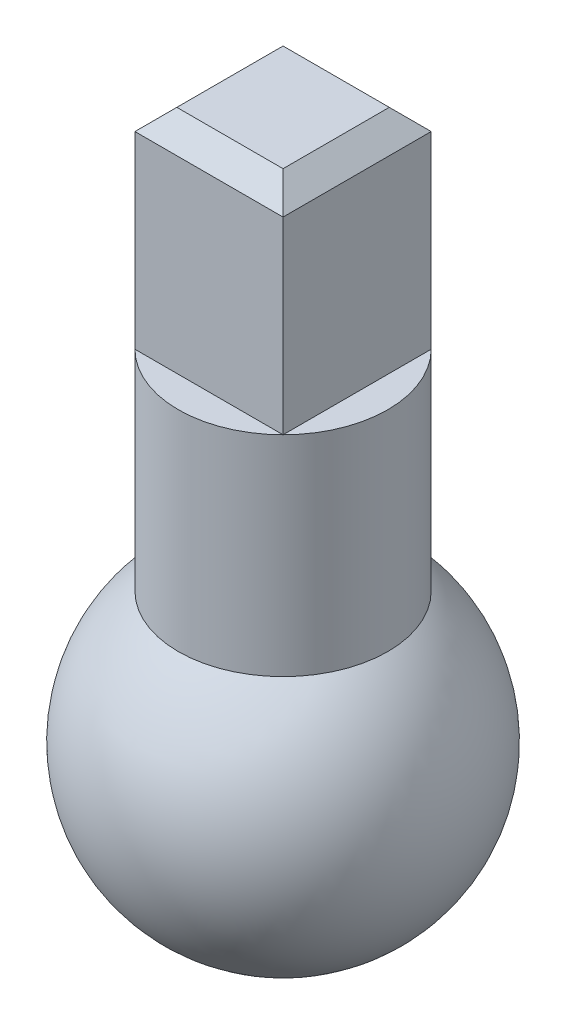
from build123d import *

# Parameters (mm, degrees)
SKETCH1_R           = 2.5
BOSS_EXTRUDE1_DEPTH = 5
SKETCH2_W           = 3.535533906
SKETCH2_H           = 3.535533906
BOSS_EXTRUDE2_DEPTH = 5
CHAMFER1_SIZE       = 0.5
DOME1_FACE_RADIUS   = 2.5
DOME1_HEIGHT        = 7.1


with BuildPart() as part:
    # Sketch1 → Boss-Extrude1 (new body)
    with BuildSketch(Plane(origin=(0, 0, 0), x_dir=(1, 0, 0), z_dir=(0, 1, 0))):
        with Locations(Location((0, 0, 0), (0, 0, 270))):
            Circle(SKETCH1_R)
    extrude(amount=BOSS_EXTRUDE1_DEPTH)

    # Sketch2 → Boss-Extrude2 (add)
    with BuildSketch(Plane(origin=(0, 5, 0), x_dir=(1, 0, 0), z_dir=(0, 1, 0))):
        Rectangle(SKETCH2_W, SKETCH2_H)
    extrude(amount=BOSS_EXTRUDE2_DEPTH)

    # Chamfer1
    chamfer1_edges = [part.edges().sort_by_distance(p)[0] for p in [
        (-1.767766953, 10, 0),
        (0, 10, 1.767766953),
        (1.767766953, 10, 0),
        (0, 10, -1.767766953),
    ]]
    chamfer(chamfer1_edges, length=CHAMFER1_SIZE)

    # Dome1: a dome of height H over a round flat face of radius A is a cap of a sphere of radius (A * A + H * H) / (2 * H)
    dome1_r = (DOME1_FACE_RADIUS * DOME1_FACE_RADIUS + DOME1_HEIGHT * DOME1_HEIGHT) / (2 * DOME1_HEIGHT)
    dome1_base = Plane((0, 0, 0), z_dir=(0, -1, 0))
    with Locations(dome1_base.offset(DOME1_HEIGHT - dome1_r)):
        dome1_ball = Sphere(dome1_r, mode=Mode.PRIVATE)
    add(split(dome1_ball, bisect_by=dome1_base, keep=Keep.TOP, mode=Mode.PRIVATE))


solid = part.part
